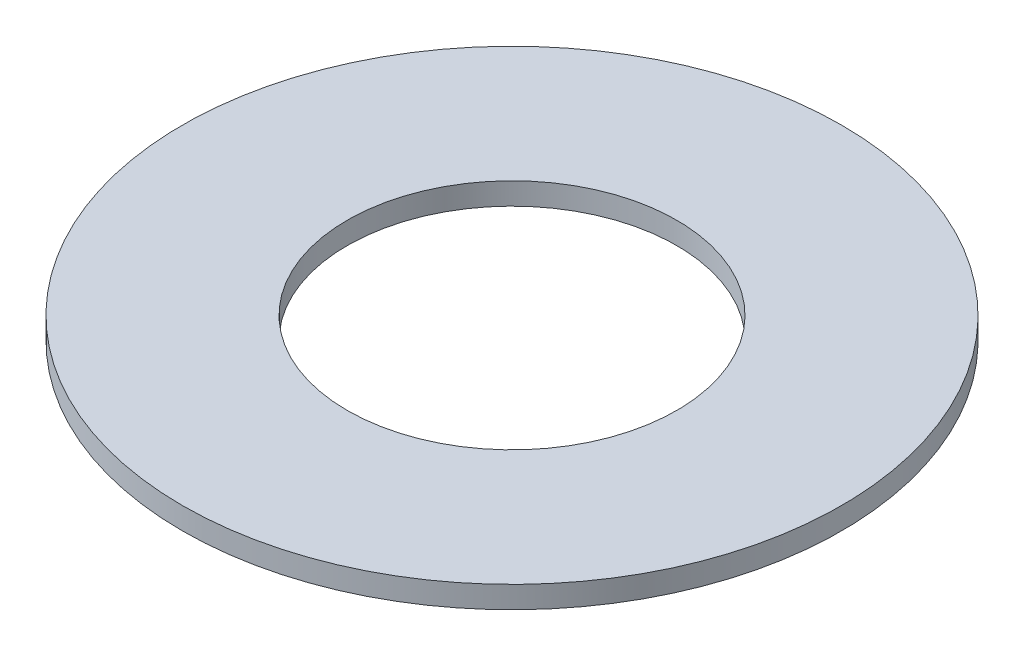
from build123d import *

# Parameters (mm, degrees)
SKIZZE2_R                       = 3
SKIZZE2_R_2                     = 1.5
AUFSATZ_LINEAR_AUSTRAGEN1_DEPTH = 0.2


with BuildPart() as part:
    # Skizze2 → Aufsatz-Linear austragen1 (new body)
    with BuildSketch(Plane(origin=(0, 0, 0), x_dir=(1, 0, 0), z_dir=(0, 1, 0))):
        with Locations(Location((0, 0, 0), (0, 0, 270))):
            Circle(SKIZZE2_R)
        with Locations(Location((0, 0, 0), (0, 0, 270))):
            Circle(SKIZZE2_R_2, mode=Mode.SUBTRACT)
    extrude(amount=AUFSATZ_LINEAR_AUSTRAGEN1_DEPTH)


solid = part.part
